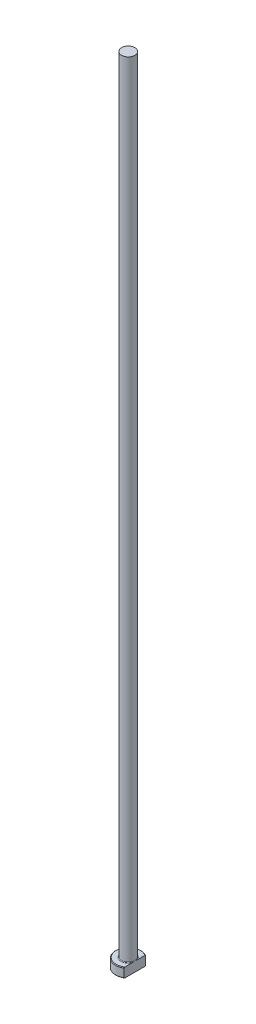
from build123d import *
from build123d.topology import SkipClean

# Parameters (mm, degrees)
CHAMFER1_SIZE = 0.2
FILLET1_R     = 0.2
KEY_DEPTH     = 251.06399181


with BuildPart() as part:
    # Sketch1 → Revolve1 (revolve)
    with BuildSketch(Plane.XY, mode=Mode.PRIVATE) as revolve1_sk:
        Polygon((0, 0), (-4, 0), (-4, 3), (-2.1, 3), (-2.1, 250), (0, 250), align=None)
    revolve(revolve1_sk.sketch.rotate(Axis((0, 259.958771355, 0), (0, -1, 0)), 270), axis=Axis((0, 259.958771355, 0), (0, -1, 0)))

    # Chamfer1
    chamfer1_edges = [part.edges().sort_by_distance(p)[0] for p in [
        (0, 3, -4),
        (0, 0, -4),
    ]]
    chamfer(chamfer1_edges, length=CHAMFER1_SIZE)

    # Fillet1
    fillet1_edges = [part.edges().sort_by_distance(p)[0] for p in [
        (0, 3, -2.1),
    ]]
    fillet(fillet1_edges, radius=FILLET1_R)

    # Sketch2 → KEY (cut, through all)
    with SkipClean():  # the faces are left unmerged after this step: merging them gives an invalid solid
        with BuildSketch(Plane(origin=(0, 0, 0), x_dir=(1, 0, 0), z_dir=(0, 1, 0))):
            with BuildLine():
                Line((2.1, 3.404408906), (2.1, -3.404408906))
                ThreePointArc((2.1, -3.404408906), (4, 0), (2.1, 3.404408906))
            make_face()
        extrude(amount=KEY_DEPTH, mode=Mode.SUBTRACT)


solid = part.part
